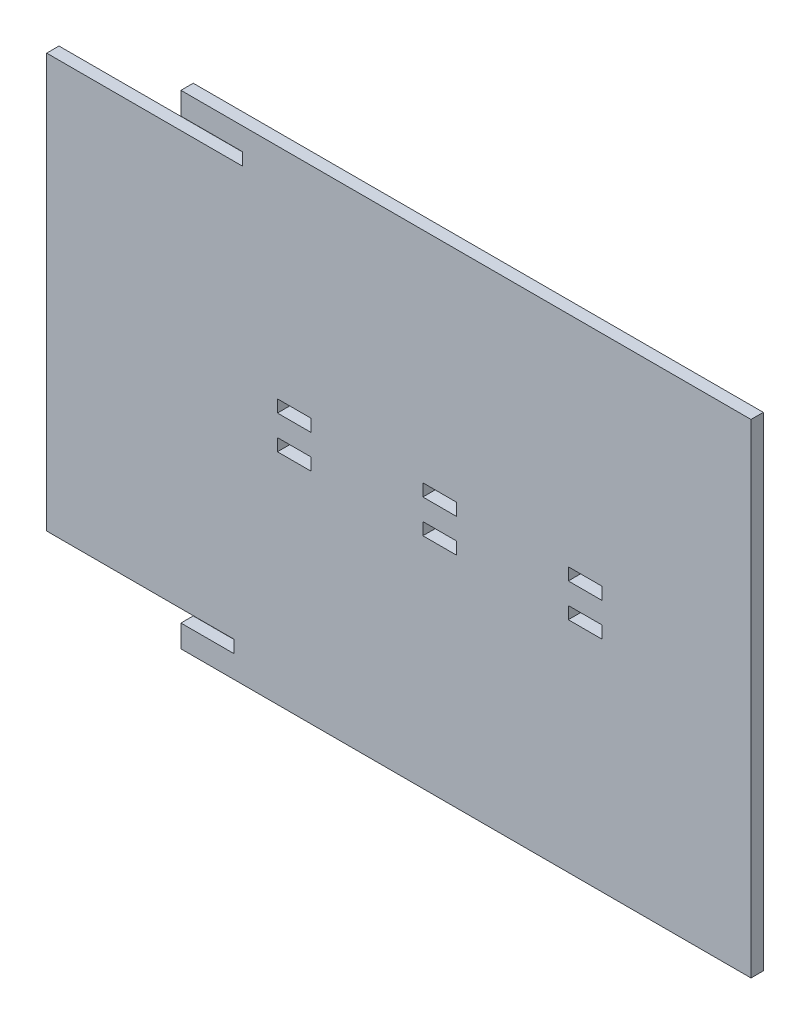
from build123d import *

# Parameters (mm, degrees)
SALIENTE_EXTRUIR1_DEPTH = 5.5
CROQUIS2_W              = 15
CROQUIS2_H              = 5.5
CORTAR_EXTRUIR2_DEPTH   = 5.5


with BuildPart() as part:
    # Croquis1 → Saliente-Extruir1 (new body)
    with BuildSketch(Plane.XY):
        Polygon((27.331158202, -0.2), (27.331158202, -216.4), (-227.473920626, -216.4), (-227.473920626, -206.4), (-203.831058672, -206.4), (-203.831058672, -200.8), (-287.473920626, -200.8), (-287.473920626, -15.8), (-200, -15.8), (-200, -10.2), (-227.473920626, -10.2), (-227.473920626, -0.2), align=None)
    extrude(amount=SALIENTE_EXTRUIR1_DEPTH)

    # Croquis2 → Cortar-Extruir2 (cut)
    with BuildSketch(Plane.XY.offset(5.5)):
        with Locations((-46.837001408, -115.8)):
            Rectangle(CROQUIS2_W, CROQUIS2_H)
        with Locations((-111.837001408, -100.8)):
            Rectangle(CROQUIS2_W, CROQUIS2_H)
        with Locations((-176.837001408, -100.8)):
            Rectangle(CROQUIS2_W, CROQUIS2_H)
        with Locations((-46.837001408, -100.8)):
            Rectangle(CROQUIS2_W, CROQUIS2_H)
        with Locations((-111.837001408, -115.8)):
            Rectangle(CROQUIS2_W, CROQUIS2_H)
        with Locations((-176.837001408, -115.8)):
            Rectangle(CROQUIS2_W, CROQUIS2_H)
    extrude(amount=-CORTAR_EXTRUIR2_DEPTH, mode=Mode.SUBTRACT)


solid = part.part
